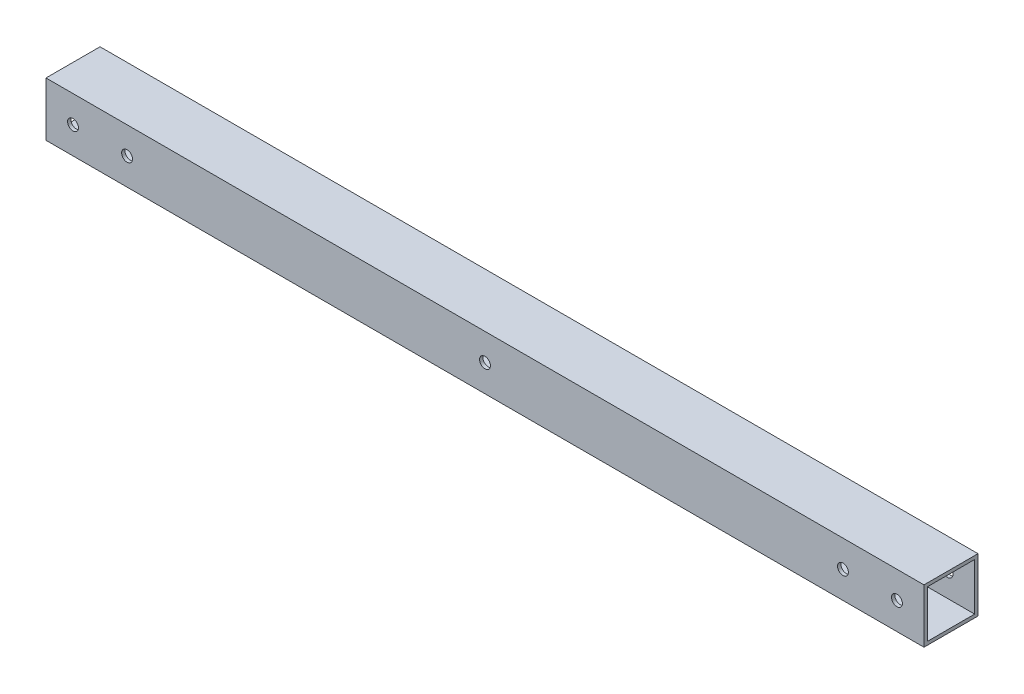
ISO-10303-21;
HEADER;
FILE_DESCRIPTION(('STEP AP214'),'2;1');
FILE_NAME('part.step','',(''),(''),'','','');
FILE_SCHEMA(('AUTOMOTIVE_DESIGN { 1 0 10303 214 1 1 1 1 }'));
ENDSEC;
DATA;
#1=APPLICATION_CONTEXT('core data for automotive mechanical design processes');
#2=APPLICATION_PROTOCOL_DEFINITION('international standard','automotive_design',2000,#1);
#3=PRODUCT_CONTEXT('',#1,'mechanical');
#4=PRODUCT('Part','Part','',(#3));
#5=PRODUCT_RELATED_PRODUCT_CATEGORY('part','',(#4));
#6=PRODUCT_DEFINITION_FORMATION('','',#4);
#7=PRODUCT_DEFINITION_CONTEXT('part definition',#1,'design');
#8=PRODUCT_DEFINITION('design','',#6,#7);
#9=PRODUCT_DEFINITION_SHAPE('','',#8);
#10=(LENGTH_UNIT() NAMED_UNIT(*) SI_UNIT(.MILLI.,.METRE.));
#11=(NAMED_UNIT(*) PLANE_ANGLE_UNIT() SI_UNIT($,.RADIAN.));
#12=(NAMED_UNIT(*) SI_UNIT($,.STERADIAN.) SOLID_ANGLE_UNIT());
#13=UNCERTAINTY_MEASURE_WITH_UNIT(LENGTH_MEASURE(1.E-05),#10,'distance_accuracy_value','');
#14=(GEOMETRIC_REPRESENTATION_CONTEXT(3) GLOBAL_UNCERTAINTY_ASSIGNED_CONTEXT((#13)) GLOBAL_UNIT_ASSIGNED_CONTEXT((#10,
#11,#12)) REPRESENTATION_CONTEXT('',''));
#15=CARTESIAN_POINT('',(0.,0.,0.));
#16=DIRECTION('',(0.,0.,1.));
#17=DIRECTION('',(1.,0.,0.));
#18=AXIS2_PLACEMENT_3D('',#15,#16,#17);
#19=CARTESIAN_POINT('',(412.75,0.,0.));
#20=DIRECTION('',(-1.,0.,0.));
#21=DIRECTION('',(0.,0.,1.));
#22=AXIS2_PLACEMENT_3D('',#19,#20,#21);
#23=PLANE('',#22);
#24=DIRECTION('',(0.,1.,0.));
#25=VECTOR('',#24,1.);
#26=CARTESIAN_POINT('',(412.75,-12.7,-12.7));
#27=LINE('',#26,#25);
#28=CARTESIAN_POINT('',(412.75,-12.7,-12.7));
#29=VERTEX_POINT('',#28);
#30=CARTESIAN_POINT('',(412.75,12.7,-12.7));
#31=VERTEX_POINT('',#30);
#32=EDGE_CURVE('E138',#29,#31,#27,.T.);
#33=ORIENTED_EDGE('',*,*,#32,.T.);
#34=DIRECTION('',(0.,0.,1.));
#35=VECTOR('',#34,1.);
#36=CARTESIAN_POINT('',(412.75,12.7,12.7));
#37=LINE('',#36,#35);
#38=CARTESIAN_POINT('',(412.75,12.7,12.7));
#39=VERTEX_POINT('',#38);
#40=EDGE_CURVE('E141',#31,#39,#37,.T.);
#41=ORIENTED_EDGE('',*,*,#40,.T.);
#42=DIRECTION('',(0.,-1.,0.));
#43=VECTOR('',#42,1.);
#44=CARTESIAN_POINT('',(412.75,-12.7,12.7));
#45=LINE('',#44,#43);
#46=CARTESIAN_POINT('',(412.75,-12.7,12.7));
#47=VERTEX_POINT('',#46);
#48=EDGE_CURVE('E144',#39,#47,#45,.T.);
#49=ORIENTED_EDGE('',*,*,#48,.T.);
#50=DIRECTION('',(0.,0.,-1.));
#51=VECTOR('',#50,1.);
#52=CARTESIAN_POINT('',(412.75,-12.7,12.7));
#53=LINE('',#52,#51);
#54=EDGE_CURVE('E146',#47,#29,#53,.T.);
#55=ORIENTED_EDGE('',*,*,#54,.T.);
#56=EDGE_LOOP('',(#33,#41,#49,#55));
#57=FACE_BOUND('',#56,.T.);
#58=DIRECTION('',(0.,1.,0.));
#59=VECTOR('',#58,1.);
#60=CARTESIAN_POINT('',(412.75,-11.1125,-11.1125));
#61=LINE('',#60,#59);
#62=CARTESIAN_POINT('',(412.75,-11.1125,-11.1125));
#63=VERTEX_POINT('',#62);
#64=CARTESIAN_POINT('',(412.75,11.1125,-11.1125));
#65=VERTEX_POINT('',#64);
#66=EDGE_CURVE('E100',#63,#65,#61,.T.);
#67=ORIENTED_EDGE('',*,*,#66,.F.);
#68=DIRECTION('',(0.,0.,-1.));
#69=VECTOR('',#68,1.);
#70=CARTESIAN_POINT('',(412.75,-11.1125,11.1125));
#71=LINE('',#70,#69);
#72=CARTESIAN_POINT('',(412.75,-11.1125,11.1125));
#73=VERTEX_POINT('',#72);
#74=EDGE_CURVE('E122',#73,#63,#71,.T.);
#75=ORIENTED_EDGE('',*,*,#74,.F.);
#76=DIRECTION('',(0.,-1.,0.));
#77=VECTOR('',#76,1.);
#78=CARTESIAN_POINT('',(412.75,-11.1125,11.1125));
#79=LINE('',#78,#77);
#80=CARTESIAN_POINT('',(412.75,11.1125,11.1125));
#81=VERTEX_POINT('',#80);
#82=EDGE_CURVE('E120',#81,#73,#79,.T.);
#83=ORIENTED_EDGE('',*,*,#82,.F.);
#84=DIRECTION('',(0.,0.,1.));
#85=VECTOR('',#84,1.);
#86=CARTESIAN_POINT('',(412.75,11.1125,11.1125));
#87=LINE('',#86,#85);
#88=EDGE_CURVE('E108',#65,#81,#87,.T.);
#89=ORIENTED_EDGE('',*,*,#88,.F.);
#90=EDGE_LOOP('',(#67,#75,#83,#89));
#91=FACE_BOUND('',#90,.T.);
#92=ADVANCED_FACE('F33',(#57,#91),#23,.F.);
#93=CARTESIAN_POINT('',(0.,0.,0.));
#94=DIRECTION('',(-1.,0.,0.));
#95=DIRECTION('',(0.,0.,1.));
#96=AXIS2_PLACEMENT_3D('',#93,#94,#95);
#97=PLANE('',#96);
#98=DIRECTION('',(0.,1.,0.));
#99=VECTOR('',#98,1.);
#100=CARTESIAN_POINT('',(0.,-12.7,-12.7));
#101=LINE('',#100,#99);
#102=CARTESIAN_POINT('',(0.,-12.7,-12.7));
#103=VERTEX_POINT('',#102);
#104=CARTESIAN_POINT('',(0.,12.7,-12.7));
#105=VERTEX_POINT('',#104);
#106=EDGE_CURVE('E116',#103,#105,#101,.T.);
#107=ORIENTED_EDGE('',*,*,#106,.F.);
#108=DIRECTION('',(0.,0.,-1.));
#109=VECTOR('',#108,1.);
#110=CARTESIAN_POINT('',(0.,-12.7,12.7));
#111=LINE('',#110,#109);
#112=CARTESIAN_POINT('',(0.,-12.7,12.7));
#113=VERTEX_POINT('',#112);
#114=EDGE_CURVE('E142',#113,#103,#111,.T.);
#115=ORIENTED_EDGE('',*,*,#114,.F.);
#116=DIRECTION('',(0.,-1.,0.));
#117=VECTOR('',#116,1.);
#118=CARTESIAN_POINT('',(0.,-12.7,12.7));
#119=LINE('',#118,#117);
#120=CARTESIAN_POINT('',(0.,12.7,12.7));
#121=VERTEX_POINT('',#120);
#122=EDGE_CURVE('E153',#121,#113,#119,.T.);
#123=ORIENTED_EDGE('',*,*,#122,.F.);
#124=DIRECTION('',(0.,0.,1.));
#125=VECTOR('',#124,1.);
#126=CARTESIAN_POINT('',(0.,12.7,12.7));
#127=LINE('',#126,#125);
#128=EDGE_CURVE('E151',#105,#121,#127,.T.);
#129=ORIENTED_EDGE('',*,*,#128,.F.);
#130=EDGE_LOOP('',(#107,#115,#123,#129));
#131=FACE_BOUND('',#130,.T.);
#132=DIRECTION('',(0.,0.,-1.));
#133=VECTOR('',#132,1.);
#134=CARTESIAN_POINT('',(0.,-11.1125,11.1125));
#135=LINE('',#134,#133);
#136=CARTESIAN_POINT('',(0.,-11.1125,11.1125));
#137=VERTEX_POINT('',#136);
#138=CARTESIAN_POINT('',(0.,-11.1125,-11.1125));
#139=VERTEX_POINT('',#138);
#140=EDGE_CURVE('E109',#137,#139,#135,.T.);
#141=ORIENTED_EDGE('',*,*,#140,.T.);
#142=DIRECTION('',(0.,1.,0.));
#143=VECTOR('',#142,1.);
#144=CARTESIAN_POINT('',(0.,-11.1125,-11.1125));
#145=LINE('',#144,#143);
#146=CARTESIAN_POINT('',(0.,11.1125,-11.1125));
#147=VERTEX_POINT('',#146);
#148=EDGE_CURVE('E58',#139,#147,#145,.T.);
#149=ORIENTED_EDGE('',*,*,#148,.T.);
#150=DIRECTION('',(0.,0.,1.));
#151=VECTOR('',#150,1.);
#152=CARTESIAN_POINT('',(0.,11.1125,11.1125));
#153=LINE('',#152,#151);
#154=CARTESIAN_POINT('',(0.,11.1125,11.1125));
#155=VERTEX_POINT('',#154);
#156=EDGE_CURVE('E115',#147,#155,#153,.T.);
#157=ORIENTED_EDGE('',*,*,#156,.T.);
#158=DIRECTION('',(0.,-1.,0.));
#159=VECTOR('',#158,1.);
#160=CARTESIAN_POINT('',(0.,-11.1125,11.1125));
#161=LINE('',#160,#159);
#162=EDGE_CURVE('E130',#155,#137,#161,.T.);
#163=ORIENTED_EDGE('',*,*,#162,.T.);
#164=EDGE_LOOP('',(#141,#149,#157,#163));
#165=FACE_BOUND('',#164,.T.);
#166=ADVANCED_FACE('F235',(#131,#165),#97,.T.);
#167=CARTESIAN_POINT('',(412.75,-12.7,-12.7));
#168=DIRECTION('',(0.,0.,1.));
#169=DIRECTION('',(1.,0.,0.));
#170=AXIS2_PLACEMENT_3D('',#167,#168,#169);
#171=PLANE('',#170);
#172=CARTESIAN_POINT('',(400.05,0.,-12.7));
#173=DIRECTION('',(0.,0.,1.));
#174=DIRECTION('',(1.,0.,0.));
#175=AXIS2_PLACEMENT_3D('',#172,#173,#174);
#176=CIRCLE('',#175,2.55270000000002);
#177=CARTESIAN_POINT('',(402.6027,0.,-12.7));
#178=VERTEX_POINT('',#177);
#179=EDGE_CURVE('E307',#178,#178,#176,.T.);
#180=ORIENTED_EDGE('',*,*,#179,.T.);
#181=EDGE_LOOP('',(#180));
#182=FACE_BOUND('',#181,.T.);
#183=CARTESIAN_POINT('',(374.65,0.,-12.7));
#184=DIRECTION('',(0.,0.,1.));
#185=DIRECTION('',(1.,0.,0.));
#186=AXIS2_PLACEMENT_3D('',#183,#184,#185);
#187=CIRCLE('',#186,2.55270000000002);
#188=CARTESIAN_POINT('',(377.2027,0.,-12.7));
#189=VERTEX_POINT('',#188);
#190=EDGE_CURVE('E179',#189,#189,#187,.T.);
#191=ORIENTED_EDGE('',*,*,#190,.T.);
#192=EDGE_LOOP('',(#191));
#193=FACE_BOUND('',#192,.T.);
#194=CARTESIAN_POINT('',(12.7,0.,-12.7));
#195=DIRECTION('',(0.,0.,1.));
#196=DIRECTION('',(1.,0.,0.));
#197=AXIS2_PLACEMENT_3D('',#194,#195,#196);
#198=CIRCLE('',#197,2.55269999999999);
#199=CARTESIAN_POINT('',(15.2527,0.,-12.7));
#200=VERTEX_POINT('',#199);
#201=EDGE_CURVE('E175',#200,#200,#198,.T.);
#202=ORIENTED_EDGE('',*,*,#201,.T.);
#203=EDGE_LOOP('',(#202));
#204=FACE_BOUND('',#203,.T.);
#205=CARTESIAN_POINT('',(38.1,0.,-12.7));
#206=DIRECTION('',(0.,0.,1.));
#207=DIRECTION('',(1.,0.,0.));
#208=AXIS2_PLACEMENT_3D('',#205,#206,#207);
#209=CIRCLE('',#208,2.55269999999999);
#210=CARTESIAN_POINT('',(40.6527,0.,-12.7));
#211=VERTEX_POINT('',#210);
#212=EDGE_CURVE('E171',#211,#211,#209,.T.);
#213=ORIENTED_EDGE('',*,*,#212,.T.);
#214=EDGE_LOOP('',(#213));
#215=FACE_BOUND('',#214,.T.);
#216=CARTESIAN_POINT('',(206.375,0.,-12.7));
#217=DIRECTION('',(0.,0.,1.));
#218=DIRECTION('',(1.,0.,0.));
#219=AXIS2_PLACEMENT_3D('',#216,#217,#218);
#220=CIRCLE('',#219,2.55269999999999);
#221=CARTESIAN_POINT('',(208.9277,0.,-12.7));
#222=VERTEX_POINT('',#221);
#223=EDGE_CURVE('E166',#222,#222,#220,.T.);
#224=ORIENTED_EDGE('',*,*,#223,.T.);
#225=EDGE_LOOP('',(#224));
#226=FACE_BOUND('',#225,.T.);
#227=ORIENTED_EDGE('',*,*,#106,.T.);
#228=DIRECTION('',(-1.,0.,0.));
#229=VECTOR('',#228,1.);
#230=CARTESIAN_POINT('',(412.75,12.7,-12.7));
#231=LINE('',#230,#229);
#232=EDGE_CURVE('E11',#31,#105,#231,.T.);
#233=ORIENTED_EDGE('',*,*,#232,.F.);
#234=ORIENTED_EDGE('',*,*,#32,.F.);
#235=DIRECTION('',(-1.,0.,0.));
#236=VECTOR('',#235,1.);
#237=CARTESIAN_POINT('',(412.75,-12.7,-12.7));
#238=LINE('',#237,#236);
#239=EDGE_CURVE('E148',#29,#103,#238,.T.);
#240=ORIENTED_EDGE('',*,*,#239,.T.);
#241=EDGE_LOOP('',(#227,#233,#234,#240));
#242=FACE_BOUND('',#241,.T.);
#243=ADVANCED_FACE('F35',(#182,#193,#204,#215,#226,#242),#171,.F.);
#244=CARTESIAN_POINT('',(412.75,12.7,12.7));
#245=DIRECTION('',(0.,-1.,0.));
#246=DIRECTION('',(0.,0.,-1.));
#247=AXIS2_PLACEMENT_3D('',#244,#245,#246);
#248=PLANE('',#247);
#249=ORIENTED_EDGE('',*,*,#128,.T.);
#250=DIRECTION('',(-1.,0.,0.));
#251=VECTOR('',#250,1.);
#252=CARTESIAN_POINT('',(412.75,12.7,12.7));
#253=LINE('',#252,#251);
#254=EDGE_CURVE('E42',#39,#121,#253,.T.);
#255=ORIENTED_EDGE('',*,*,#254,.F.);
#256=ORIENTED_EDGE('',*,*,#40,.F.);
#257=ORIENTED_EDGE('',*,*,#232,.T.);
#258=EDGE_LOOP('',(#249,#255,#256,#257));
#259=FACE_BOUND('',#258,.T.);
#260=ADVANCED_FACE('F244',(#259),#248,.F.);
#261=CARTESIAN_POINT('',(412.75,-12.7,12.7));
#262=DIRECTION('',(0.,0.,-1.));
#263=DIRECTION('',(-1.,0.,0.));
#264=AXIS2_PLACEMENT_3D('',#261,#262,#263);
#265=PLANE('',#264);
#266=CARTESIAN_POINT('',(400.05,0.,12.7));
#267=DIRECTION('',(0.,0.,1.));
#268=DIRECTION('',(1.,0.,0.));
#269=AXIS2_PLACEMENT_3D('',#266,#267,#268);
#270=CIRCLE('',#269,2.55269999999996);
#271=CARTESIAN_POINT('',(402.6027,0.,12.7));
#272=VERTEX_POINT('',#271);
#273=EDGE_CURVE('E308',#272,#272,#270,.T.);
#274=ORIENTED_EDGE('',*,*,#273,.F.);
#275=EDGE_LOOP('',(#274));
#276=FACE_BOUND('',#275,.T.);
#277=CARTESIAN_POINT('',(374.65,0.,12.7));
#278=DIRECTION('',(0.,0.,1.));
#279=DIRECTION('',(1.,0.,0.));
#280=AXIS2_PLACEMENT_3D('',#277,#278,#279);
#281=CIRCLE('',#280,2.55269999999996);
#282=CARTESIAN_POINT('',(377.2027,0.,12.7));
#283=VERTEX_POINT('',#282);
#284=EDGE_CURVE('E186',#283,#283,#281,.T.);
#285=ORIENTED_EDGE('',*,*,#284,.F.);
#286=EDGE_LOOP('',(#285));
#287=FACE_BOUND('',#286,.T.);
#288=CARTESIAN_POINT('',(12.7,0.,12.7));
#289=DIRECTION('',(0.,0.,1.));
#290=DIRECTION('',(1.,0.,0.));
#291=AXIS2_PLACEMENT_3D('',#288,#289,#290);
#292=CIRCLE('',#291,2.55269999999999);
#293=CARTESIAN_POINT('',(15.2527,0.,12.7));
#294=VERTEX_POINT('',#293);
#295=EDGE_CURVE('E183',#294,#294,#292,.T.);
#296=ORIENTED_EDGE('',*,*,#295,.F.);
#297=EDGE_LOOP('',(#296));
#298=FACE_BOUND('',#297,.T.);
#299=CARTESIAN_POINT('',(38.1,0.,12.7));
#300=DIRECTION('',(0.,0.,1.));
#301=DIRECTION('',(1.,0.,0.));
#302=AXIS2_PLACEMENT_3D('',#299,#300,#301);
#303=CIRCLE('',#302,2.55269999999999);
#304=CARTESIAN_POINT('',(40.6527,0.,12.7));
#305=VERTEX_POINT('',#304);
#306=EDGE_CURVE('E201',#305,#305,#303,.T.);
#307=ORIENTED_EDGE('',*,*,#306,.F.);
#308=EDGE_LOOP('',(#307));
#309=FACE_BOUND('',#308,.T.);
#310=CARTESIAN_POINT('',(206.375,0.,12.7));
#311=DIRECTION('',(0.,0.,1.));
#312=DIRECTION('',(1.,0.,0.));
#313=AXIS2_PLACEMENT_3D('',#310,#311,#312);
#314=CIRCLE('',#313,2.55269999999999);
#315=CARTESIAN_POINT('',(208.9277,0.,12.7));
#316=VERTEX_POINT('',#315);
#317=EDGE_CURVE('E208',#316,#316,#314,.T.);
#318=ORIENTED_EDGE('',*,*,#317,.F.);
#319=EDGE_LOOP('',(#318));
#320=FACE_BOUND('',#319,.T.);
#321=ORIENTED_EDGE('',*,*,#122,.T.);
#322=DIRECTION('',(-1.,0.,0.));
#323=VECTOR('',#322,1.);
#324=CARTESIAN_POINT('',(412.75,-12.7,12.7));
#325=LINE('',#324,#323);
#326=EDGE_CURVE('E158',#47,#113,#325,.T.);
#327=ORIENTED_EDGE('',*,*,#326,.F.);
#328=ORIENTED_EDGE('',*,*,#48,.F.);
#329=ORIENTED_EDGE('',*,*,#254,.T.);
#330=EDGE_LOOP('',(#321,#327,#328,#329));
#331=FACE_BOUND('',#330,.T.);
#332=ADVANCED_FACE('F228',(#276,#287,#298,#309,#320,#331),#265,.F.);
#333=CARTESIAN_POINT('',(412.75,-12.7,12.7));
#334=DIRECTION('',(0.,1.,0.));
#335=DIRECTION('',(0.,0.,1.));
#336=AXIS2_PLACEMENT_3D('',#333,#334,#335);
#337=PLANE('',#336);
#338=ORIENTED_EDGE('',*,*,#114,.T.);
#339=ORIENTED_EDGE('',*,*,#239,.F.);
#340=ORIENTED_EDGE('',*,*,#54,.F.);
#341=ORIENTED_EDGE('',*,*,#326,.T.);
#342=EDGE_LOOP('',(#338,#339,#340,#341));
#343=FACE_BOUND('',#342,.T.);
#344=ADVANCED_FACE('F219',(#343),#337,.F.);
#345=CARTESIAN_POINT('',(412.75,-11.1125,-11.1125));
#346=DIRECTION('',(0.,0.,1.));
#347=DIRECTION('',(1.,0.,0.));
#348=AXIS2_PLACEMENT_3D('',#345,#346,#347);
#349=PLANE('',#348);
#350=CARTESIAN_POINT('',(400.05,0.,-11.1125));
#351=DIRECTION('',(0.,0.,1.));
#352=DIRECTION('',(1.,0.,0.));
#353=AXIS2_PLACEMENT_3D('',#350,#351,#352);
#354=CIRCLE('',#353,2.55269999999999);
#355=CARTESIAN_POINT('',(402.6027,0.,-11.1125));
#356=VERTEX_POINT('',#355);
#357=EDGE_CURVE('E37',#356,#356,#354,.T.);
#358=ORIENTED_EDGE('',*,*,#357,.F.);
#359=EDGE_LOOP('',(#358));
#360=FACE_BOUND('',#359,.T.);
#361=CARTESIAN_POINT('',(374.65,0.,-11.1125));
#362=DIRECTION('',(0.,0.,1.));
#363=DIRECTION('',(1.,0.,0.));
#364=AXIS2_PLACEMENT_3D('',#361,#362,#363);
#365=CIRCLE('',#364,2.55269999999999);
#366=CARTESIAN_POINT('',(377.2027,0.,-11.1125));
#367=VERTEX_POINT('',#366);
#368=EDGE_CURVE('E176',#367,#367,#365,.T.);
#369=ORIENTED_EDGE('',*,*,#368,.F.);
#370=EDGE_LOOP('',(#369));
#371=FACE_BOUND('',#370,.T.);
#372=CARTESIAN_POINT('',(12.7,0.,-11.1125));
#373=DIRECTION('',(0.,0.,1.));
#374=DIRECTION('',(1.,0.,0.));
#375=AXIS2_PLACEMENT_3D('',#372,#373,#374);
#376=CIRCLE('',#375,2.55269999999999);
#377=CARTESIAN_POINT('',(15.2527,0.,-11.1125));
#378=VERTEX_POINT('',#377);
#379=EDGE_CURVE('E174',#378,#378,#376,.T.);
#380=ORIENTED_EDGE('',*,*,#379,.F.);
#381=EDGE_LOOP('',(#380));
#382=FACE_BOUND('',#381,.T.);
#383=CARTESIAN_POINT('',(38.1,0.,-11.1125));
#384=DIRECTION('',(0.,0.,1.));
#385=DIRECTION('',(1.,0.,0.));
#386=AXIS2_PLACEMENT_3D('',#383,#384,#385);
#387=CIRCLE('',#386,2.55269999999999);
#388=CARTESIAN_POINT('',(40.6527,0.,-11.1125));
#389=VERTEX_POINT('',#388);
#390=EDGE_CURVE('E167',#389,#389,#387,.T.);
#391=ORIENTED_EDGE('',*,*,#390,.F.);
#392=EDGE_LOOP('',(#391));
#393=FACE_BOUND('',#392,.T.);
#394=CARTESIAN_POINT('',(206.375,0.,-11.1125));
#395=DIRECTION('',(0.,0.,1.));
#396=DIRECTION('',(1.,0.,0.));
#397=AXIS2_PLACEMENT_3D('',#394,#395,#396);
#398=CIRCLE('',#397,2.55269999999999);
#399=CARTESIAN_POINT('',(208.9277,0.,-11.1125));
#400=VERTEX_POINT('',#399);
#401=EDGE_CURVE('E128',#400,#400,#398,.T.);
#402=ORIENTED_EDGE('',*,*,#401,.F.);
#403=EDGE_LOOP('',(#402));
#404=FACE_BOUND('',#403,.T.);
#405=ORIENTED_EDGE('',*,*,#148,.F.);
#406=DIRECTION('',(-1.,0.,0.));
#407=VECTOR('',#406,1.);
#408=CARTESIAN_POINT('',(412.75,-11.1125,-11.1125));
#409=LINE('',#408,#407);
#410=EDGE_CURVE('E104',#63,#139,#409,.T.);
#411=ORIENTED_EDGE('',*,*,#410,.F.);
#412=ORIENTED_EDGE('',*,*,#66,.T.);
#413=DIRECTION('',(-1.,0.,0.));
#414=VECTOR('',#413,1.);
#415=CARTESIAN_POINT('',(412.75,11.1125,-11.1125));
#416=LINE('',#415,#414);
#417=EDGE_CURVE('E103',#65,#147,#416,.T.);
#418=ORIENTED_EDGE('',*,*,#417,.T.);
#419=EDGE_LOOP('',(#405,#411,#412,#418));
#420=FACE_BOUND('',#419,.T.);
#421=ADVANCED_FACE('F102',(#360,#371,#382,#393,#404,#420),#349,.T.);
#422=CARTESIAN_POINT('',(412.75,11.1125,11.1125));
#423=DIRECTION('',(0.,-1.,0.));
#424=DIRECTION('',(0.,0.,-1.));
#425=AXIS2_PLACEMENT_3D('',#422,#423,#424);
#426=PLANE('',#425);
#427=ORIENTED_EDGE('',*,*,#156,.F.);
#428=ORIENTED_EDGE('',*,*,#417,.F.);
#429=ORIENTED_EDGE('',*,*,#88,.T.);
#430=DIRECTION('',(-1.,0.,0.));
#431=VECTOR('',#430,1.);
#432=CARTESIAN_POINT('',(412.75,11.1125,11.1125));
#433=LINE('',#432,#431);
#434=EDGE_CURVE('E117',#81,#155,#433,.T.);
#435=ORIENTED_EDGE('',*,*,#434,.T.);
#436=EDGE_LOOP('',(#427,#428,#429,#435));
#437=FACE_BOUND('',#436,.T.);
#438=ADVANCED_FACE('F112',(#437),#426,.T.);
#439=CARTESIAN_POINT('',(412.75,-11.1125,11.1125));
#440=DIRECTION('',(0.,0.,-1.));
#441=DIRECTION('',(-1.,0.,0.));
#442=AXIS2_PLACEMENT_3D('',#439,#440,#441);
#443=PLANE('',#442);
#444=CARTESIAN_POINT('',(400.05,0.,11.1125));
#445=DIRECTION('',(0.,0.,-1.));
#446=DIRECTION('',(-1.,0.,0.));
#447=AXIS2_PLACEMENT_3D('',#444,#445,#446);
#448=CIRCLE('',#447,2.55269999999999);
#449=CARTESIAN_POINT('',(397.4973,0.,11.1125));
#450=VERTEX_POINT('',#449);
#451=EDGE_CURVE('E191',#450,#450,#448,.T.);
#452=ORIENTED_EDGE('',*,*,#451,.F.);
#453=EDGE_LOOP('',(#452));
#454=FACE_BOUND('',#453,.T.);
#455=CARTESIAN_POINT('',(374.65,0.,11.1125));
#456=DIRECTION('',(0.,0.,-1.));
#457=DIRECTION('',(-1.,0.,0.));
#458=AXIS2_PLACEMENT_3D('',#455,#456,#457);
#459=CIRCLE('',#458,2.55269999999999);
#460=CARTESIAN_POINT('',(372.0973,0.,11.1125));
#461=VERTEX_POINT('',#460);
#462=EDGE_CURVE('E178',#461,#461,#459,.T.);
#463=ORIENTED_EDGE('',*,*,#462,.F.);
#464=EDGE_LOOP('',(#463));
#465=FACE_BOUND('',#464,.T.);
#466=CARTESIAN_POINT('',(12.7,0.,11.1125));
#467=DIRECTION('',(0.,0.,-1.));
#468=DIRECTION('',(-1.,0.,0.));
#469=AXIS2_PLACEMENT_3D('',#466,#467,#468);
#470=CIRCLE('',#469,2.55269999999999);
#471=CARTESIAN_POINT('',(10.1473,0.,11.1125));
#472=VERTEX_POINT('',#471);
#473=EDGE_CURVE('E172',#472,#472,#470,.T.);
#474=ORIENTED_EDGE('',*,*,#473,.F.);
#475=EDGE_LOOP('',(#474));
#476=FACE_BOUND('',#475,.T.);
#477=CARTESIAN_POINT('',(38.1,0.,11.1125));
#478=DIRECTION('',(0.,0.,-1.));
#479=DIRECTION('',(-1.,0.,0.));
#480=AXIS2_PLACEMENT_3D('',#477,#478,#479);
#481=CIRCLE('',#480,2.55269999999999);
#482=CARTESIAN_POINT('',(35.5473,0.,11.1125));
#483=VERTEX_POINT('',#482);
#484=EDGE_CURVE('E170',#483,#483,#481,.T.);
#485=ORIENTED_EDGE('',*,*,#484,.F.);
#486=EDGE_LOOP('',(#485));
#487=FACE_BOUND('',#486,.T.);
#488=CARTESIAN_POINT('',(206.375,0.,11.1125));
#489=DIRECTION('',(0.,0.,-1.));
#490=DIRECTION('',(-1.,0.,0.));
#491=AXIS2_PLACEMENT_3D('',#488,#489,#490);
#492=CIRCLE('',#491,2.55269999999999);
#493=CARTESIAN_POINT('',(203.8223,0.,11.1125));
#494=VERTEX_POINT('',#493);
#495=EDGE_CURVE('E163',#494,#494,#492,.T.);
#496=ORIENTED_EDGE('',*,*,#495,.F.);
#497=EDGE_LOOP('',(#496));
#498=FACE_BOUND('',#497,.T.);
#499=ORIENTED_EDGE('',*,*,#162,.F.);
#500=ORIENTED_EDGE('',*,*,#434,.F.);
#501=ORIENTED_EDGE('',*,*,#82,.T.);
#502=DIRECTION('',(-1.,0.,0.));
#503=VECTOR('',#502,1.);
#504=CARTESIAN_POINT('',(412.75,-11.1125,11.1125));
#505=LINE('',#504,#503);
#506=EDGE_CURVE('E50',#73,#137,#505,.T.);
#507=ORIENTED_EDGE('',*,*,#506,.T.);
#508=EDGE_LOOP('',(#499,#500,#501,#507));
#509=FACE_BOUND('',#508,.T.);
#510=ADVANCED_FACE('F226',(#454,#465,#476,#487,#498,#509),#443,.T.);
#511=CARTESIAN_POINT('',(412.75,-11.1125,11.1125));
#512=DIRECTION('',(0.,1.,0.));
#513=DIRECTION('',(0.,0.,1.));
#514=AXIS2_PLACEMENT_3D('',#511,#512,#513);
#515=PLANE('',#514);
#516=ORIENTED_EDGE('',*,*,#140,.F.);
#517=ORIENTED_EDGE('',*,*,#506,.F.);
#518=ORIENTED_EDGE('',*,*,#74,.T.);
#519=ORIENTED_EDGE('',*,*,#410,.T.);
#520=EDGE_LOOP('',(#516,#517,#518,#519));
#521=FACE_BOUND('',#520,.T.);
#522=ADVANCED_FACE('F266',(#521),#515,.T.);
#523=CARTESIAN_POINT('',(206.375,0.,12.7));
#524=DIRECTION('',(0.,0.,1.));
#525=DIRECTION('',(1.,0.,0.));
#526=AXIS2_PLACEMENT_3D('',#523,#524,#525);
#527=CYLINDRICAL_SURFACE('',#526,2.55269999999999);
#528=ORIENTED_EDGE('',*,*,#495,.T.);
#529=EDGE_LOOP('',(#528));
#530=FACE_BOUND('',#529,.T.);
#531=ORIENTED_EDGE('',*,*,#317,.T.);
#532=EDGE_LOOP('',(#531));
#533=FACE_BOUND('',#532,.T.);
#534=ADVANCED_FACE('F268',(#530,#533),#527,.F.);
#535=ORIENTED_EDGE('',*,*,#401,.T.);
#536=EDGE_LOOP('',(#535));
#537=FACE_BOUND('',#536,.T.);
#538=ORIENTED_EDGE('',*,*,#223,.F.);
#539=EDGE_LOOP('',(#538));
#540=FACE_BOUND('',#539,.T.);
#541=ADVANCED_FACE('F215',(#537,#540),#527,.F.);
#542=CARTESIAN_POINT('',(38.1,0.,12.7));
#543=DIRECTION('',(0.,0.,1.));
#544=DIRECTION('',(1.,0.,0.));
#545=AXIS2_PLACEMENT_3D('',#542,#543,#544);
#546=CYLINDRICAL_SURFACE('',#545,2.55269999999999);
#547=ORIENTED_EDGE('',*,*,#390,.T.);
#548=EDGE_LOOP('',(#547));
#549=FACE_BOUND('',#548,.T.);
#550=ORIENTED_EDGE('',*,*,#212,.F.);
#551=EDGE_LOOP('',(#550));
#552=FACE_BOUND('',#551,.T.);
#553=ADVANCED_FACE('F279',(#549,#552),#546,.F.);
#554=ORIENTED_EDGE('',*,*,#484,.T.);
#555=EDGE_LOOP('',(#554));
#556=FACE_BOUND('',#555,.T.);
#557=ORIENTED_EDGE('',*,*,#306,.T.);
#558=EDGE_LOOP('',(#557));
#559=FACE_BOUND('',#558,.T.);
#560=ADVANCED_FACE('F282',(#556,#559),#546,.F.);
#561=CARTESIAN_POINT('',(12.7,0.,12.7));
#562=DIRECTION('',(0.,0.,1.));
#563=DIRECTION('',(1.,0.,0.));
#564=AXIS2_PLACEMENT_3D('',#561,#562,#563);
#565=CYLINDRICAL_SURFACE('',#564,2.55269999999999);
#566=ORIENTED_EDGE('',*,*,#473,.T.);
#567=EDGE_LOOP('',(#566));
#568=FACE_BOUND('',#567,.T.);
#569=ORIENTED_EDGE('',*,*,#295,.T.);
#570=EDGE_LOOP('',(#569));
#571=FACE_BOUND('',#570,.T.);
#572=ADVANCED_FACE('F284',(#568,#571),#565,.F.);
#573=ORIENTED_EDGE('',*,*,#379,.T.);
#574=EDGE_LOOP('',(#573));
#575=FACE_BOUND('',#574,.T.);
#576=ORIENTED_EDGE('',*,*,#201,.F.);
#577=EDGE_LOOP('',(#576));
#578=FACE_BOUND('',#577,.T.);
#579=ADVANCED_FACE('F287',(#575,#578),#565,.F.);
#580=CARTESIAN_POINT('',(374.65,0.,12.7));
#581=DIRECTION('',(0.,0.,1.));
#582=DIRECTION('',(1.,0.,0.));
#583=AXIS2_PLACEMENT_3D('',#580,#581,#582);
#584=CYLINDRICAL_SURFACE('',#583,2.55269999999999);
#585=ORIENTED_EDGE('',*,*,#368,.T.);
#586=EDGE_LOOP('',(#585));
#587=FACE_BOUND('',#586,.T.);
#588=ORIENTED_EDGE('',*,*,#190,.F.);
#589=EDGE_LOOP('',(#588));
#590=FACE_BOUND('',#589,.T.);
#591=ADVANCED_FACE('F289',(#587,#590),#584,.F.);
#592=ORIENTED_EDGE('',*,*,#462,.T.);
#593=EDGE_LOOP('',(#592));
#594=FACE_BOUND('',#593,.T.);
#595=ORIENTED_EDGE('',*,*,#284,.T.);
#596=EDGE_LOOP('',(#595));
#597=FACE_BOUND('',#596,.T.);
#598=ADVANCED_FACE('F292',(#594,#597),#584,.F.);
#599=CARTESIAN_POINT('',(400.05,0.,12.7));
#600=DIRECTION('',(0.,0.,1.));
#601=DIRECTION('',(1.,0.,0.));
#602=AXIS2_PLACEMENT_3D('',#599,#600,#601);
#603=CYLINDRICAL_SURFACE('',#602,2.55269999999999);
#604=ORIENTED_EDGE('',*,*,#357,.T.);
#605=EDGE_LOOP('',(#604));
#606=FACE_BOUND('',#605,.T.);
#607=ORIENTED_EDGE('',*,*,#179,.F.);
#608=EDGE_LOOP('',(#607));
#609=FACE_BOUND('',#608,.T.);
#610=ADVANCED_FACE('F293',(#606,#609),#603,.F.);
#611=ORIENTED_EDGE('',*,*,#451,.T.);
#612=EDGE_LOOP('',(#611));
#613=FACE_BOUND('',#612,.T.);
#614=ORIENTED_EDGE('',*,*,#273,.T.);
#615=EDGE_LOOP('',(#614));
#616=FACE_BOUND('',#615,.T.);
#617=ADVANCED_FACE('F295',(#613,#616),#603,.F.);
#618=CLOSED_SHELL('',(#92,#166,#243,#260,#332,#344,#421,#438,#510,#522,#534,#541,#553,#560,#572,
#579,#591,#598,#610,#617));
#619=MANIFOLD_SOLID_BREP('B2',#618);
#620=ADVANCED_BREP_SHAPE_REPRESENTATION('',(#18,#619),#14);
#621=SHAPE_DEFINITION_REPRESENTATION(#9,#620);
ENDSEC;
END-ISO-10303-21;
